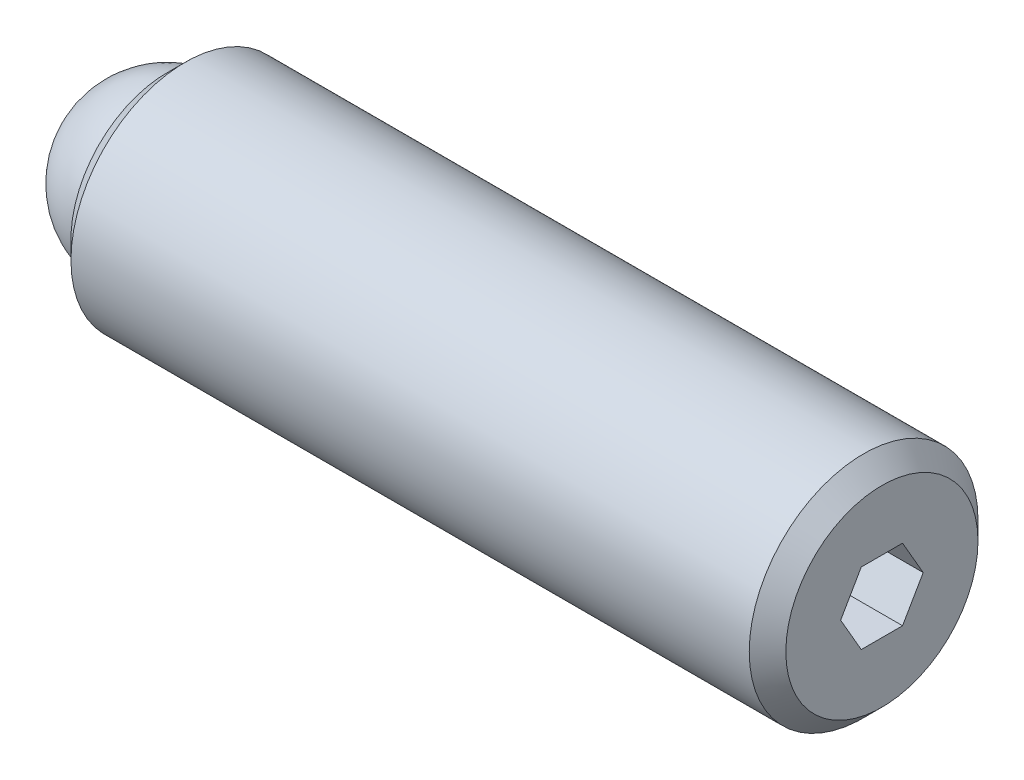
from build123d import *

# Parameters (mm, degrees)
SKETCH2_R           = 3.175
BOSS_EXTRUDE1_DEPTH = 19.84375
CHAMFER1_SIZE       = 0.508
CHAMFER2_SIZE       = 0.508
CUT_EXTRUDE2_DEPTH  = 2.286
SKETCH3_R           = 2.38125
CUT_EXTRUDE3_DEPTH  = 1.984375


with BuildPart() as part:
    # Sketch2 → Boss-Extrude1 (new body)
    with BuildSketch(Plane(origin=(0, 0, 0), x_dir=(0, 0, -1), z_dir=(1, 0, 0))):
        with Locations(Location((0, 0, 0), (0, 0, 180))):
            Circle(SKETCH2_R)
    extrude(amount=BOSS_EXTRUDE1_DEPTH)

    # Chamfer1
    chamfer1_edges = [part.edges().sort_by_distance(p)[0] for p in [
        (0, 0, -3.175),
    ]]
    chamfer(chamfer1_edges, length=CHAMFER1_SIZE)

    # Chamfer2
    chamfer2_edges = [part.edges().sort_by_distance(p)[0] for p in [
        (19.84375, 0, -3.175),
    ]]
    chamfer(chamfer2_edges, length=CHAMFER2_SIZE)

    # Sketch4 → Cut-Extrude2 (cut)
    with BuildSketch(Plane(origin=(19.84375, 0, 0), x_dir=(0, 0, -1), z_dir=(1, 0, 0))):
        Polygon((1.14567944, 0), (0.57283972, 0.9921875), (-0.57283972, 0.9921875), (-1.14567944, 0), (-0.57283972, -0.9921875), (0.57283972, -0.9921875), align=None)
    extrude(amount=-CUT_EXTRUDE2_DEPTH, mode=Mode.SUBTRACT)

    # Sketch3 → Cut-Extrude3 (cut)
    with BuildSketch(Plane.ZY):
        Circle(SKETCH3_R)
    extrude(amount=-CUT_EXTRUDE3_DEPTH, mode=Mode.SUBTRACT)


with BuildPart() as body_2:
    # Sketch5 → Revolve1 (revolve)
    with BuildSketch(Plane.ZY):
        with BuildLine():
            Line((0, 0), (0, -2.38125))
            ThreePointArc((0, -2.38125), (-2.38125, 0), (0, 2.38125))
            Line((0, 2.38125), (0, 0))
        make_face()
    revolve(axis=Axis((0, 0, 0), (0, 1, 0)))


solid = Compound([part.part, body_2.part])
